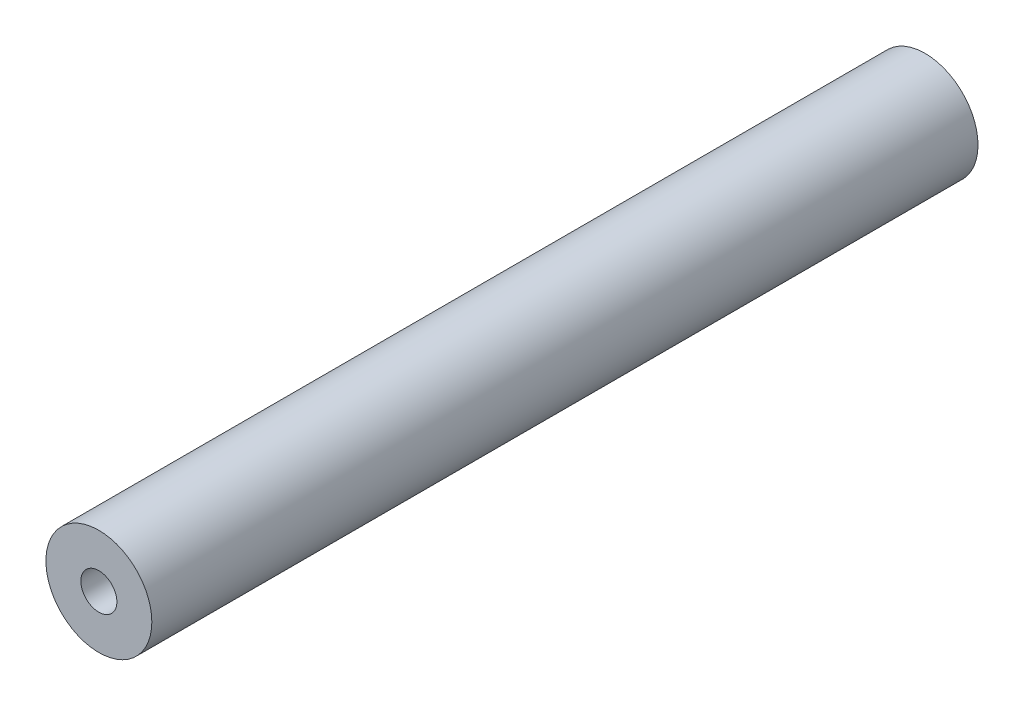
ISO-10303-21;
HEADER;
FILE_DESCRIPTION(('STEP AP214'),'2;1');
FILE_NAME('part.step','',(''),(''),'','','');
FILE_SCHEMA(('AUTOMOTIVE_DESIGN { 1 0 10303 214 1 1 1 1 }'));
ENDSEC;
DATA;
#1=APPLICATION_CONTEXT('core data for automotive mechanical design processes');
#2=APPLICATION_PROTOCOL_DEFINITION('international standard','automotive_design',2000,#1);
#3=PRODUCT_CONTEXT('',#1,'mechanical');
#4=PRODUCT('Part','Part','',(#3));
#5=PRODUCT_RELATED_PRODUCT_CATEGORY('part','',(#4));
#6=PRODUCT_DEFINITION_FORMATION('','',#4);
#7=PRODUCT_DEFINITION_CONTEXT('part definition',#1,'design');
#8=PRODUCT_DEFINITION('design','',#6,#7);
#9=PRODUCT_DEFINITION_SHAPE('','',#8);
#10=(LENGTH_UNIT() NAMED_UNIT(*) SI_UNIT(.MILLI.,.METRE.));
#11=(NAMED_UNIT(*) PLANE_ANGLE_UNIT() SI_UNIT($,.RADIAN.));
#12=(NAMED_UNIT(*) SI_UNIT($,.STERADIAN.) SOLID_ANGLE_UNIT());
#13=UNCERTAINTY_MEASURE_WITH_UNIT(LENGTH_MEASURE(1.E-05),#10,'distance_accuracy_value','');
#14=(GEOMETRIC_REPRESENTATION_CONTEXT(3) GLOBAL_UNCERTAINTY_ASSIGNED_CONTEXT((#13)) GLOBAL_UNIT_ASSIGNED_CONTEXT((#10,
#11,#12)) REPRESENTATION_CONTEXT('',''));
#15=CARTESIAN_POINT('',(0.,0.,0.));
#16=DIRECTION('',(0.,0.,1.));
#17=DIRECTION('',(1.,0.,0.));
#18=AXIS2_PLACEMENT_3D('',#15,#16,#17);
#19=CARTESIAN_POINT('',(0.,1.52655665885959E-13,195.));
#20=DIRECTION('',(0.,0.,-1.));
#21=DIRECTION('',(-1.,0.,0.));
#22=AXIS2_PLACEMENT_3D('',#19,#20,#21);
#23=CYLINDRICAL_SURFACE('',#22,12.5);
#24=CARTESIAN_POINT('',(0.,1.52655665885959E-13,195.));
#25=DIRECTION('',(0.,0.,1.));
#26=DIRECTION('',(1.,0.,0.));
#27=AXIS2_PLACEMENT_3D('',#24,#25,#26);
#28=CIRCLE('',#27,12.5);
#29=CARTESIAN_POINT('',(12.5,1.42160588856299E-13,195.));
#30=VERTEX_POINT('',#29);
#31=EDGE_CURVE('E12',#30,#30,#28,.T.);
#32=ORIENTED_EDGE('',*,*,#31,.F.);
#33=EDGE_LOOP('',(#32));
#34=FACE_BOUND('',#33,.T.);
#35=CARTESIAN_POINT('',(0.,0.,0.));
#36=DIRECTION('',(0.,0.,1.));
#37=DIRECTION('',(1.,0.,0.));
#38=AXIS2_PLACEMENT_3D('',#35,#36,#37);
#39=CIRCLE('',#38,12.5);
#40=CARTESIAN_POINT('',(12.5,0.,0.));
#41=VERTEX_POINT('',#40);
#42=EDGE_CURVE('E43',#41,#41,#39,.T.);
#43=ORIENTED_EDGE('',*,*,#42,.T.);
#44=EDGE_LOOP('',(#43));
#45=FACE_BOUND('',#44,.T.);
#46=ADVANCED_FACE('F37',(#34,#45),#23,.T.);
#47=CARTESIAN_POINT('',(0.,1.52655665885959E-13,195.));
#48=DIRECTION('',(0.,0.,1.));
#49=DIRECTION('',(1.,0.,0.));
#50=AXIS2_PLACEMENT_3D('',#47,#48,#49);
#51=PLANE('',#50);
#52=CARTESIAN_POINT('',(0.,1.52655665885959E-13,195.));
#53=DIRECTION('',(0.,0.,1.));
#54=DIRECTION('',(1.,0.,0.));
#55=AXIS2_PLACEMENT_3D('',#52,#53,#54);
#56=CIRCLE('',#55,4.25);
#57=CARTESIAN_POINT('',(4.25,1.49087339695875E-13,195.));
#58=VERTEX_POINT('',#57);
#59=EDGE_CURVE('E51',#58,#58,#56,.T.);
#60=ORIENTED_EDGE('',*,*,#59,.F.);
#61=EDGE_LOOP('',(#60));
#62=FACE_BOUND('',#61,.T.);
#63=ORIENTED_EDGE('',*,*,#31,.T.);
#64=EDGE_LOOP('',(#63));
#65=FACE_BOUND('',#64,.T.);
#66=ADVANCED_FACE('F69',(#62,#65),#51,.T.);
#67=CARTESIAN_POINT('',(0.,0.,0.));
#68=DIRECTION('',(0.,0.,1.));
#69=DIRECTION('',(1.,0.,0.));
#70=AXIS2_PLACEMENT_3D('',#67,#68,#69);
#71=PLANE('',#70);
#72=CARTESIAN_POINT('',(0.,0.,0.));
#73=DIRECTION('',(0.,0.,-1.));
#74=DIRECTION('',(-1.,0.,0.));
#75=AXIS2_PLACEMENT_3D('',#72,#73,#74);
#76=CIRCLE('',#75,4.25);
#77=CARTESIAN_POINT('',(-4.25,0.,0.));
#78=VERTEX_POINT('',#77);
#79=EDGE_CURVE('E59',#78,#78,#76,.T.);
#80=ORIENTED_EDGE('',*,*,#79,.F.);
#81=EDGE_LOOP('',(#80));
#82=FACE_BOUND('',#81,.T.);
#83=ORIENTED_EDGE('',*,*,#42,.F.);
#84=EDGE_LOOP('',(#83));
#85=FACE_BOUND('',#84,.T.);
#86=ADVANCED_FACE('F65',(#82,#85),#71,.F.);
#87=CARTESIAN_POINT('',(-6.10622663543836E-13,1.11022302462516E-13,175.));
#88=DIRECTION('',(0.,0.,1.));
#89=DIRECTION('',(1.,0.,0.));
#90=AXIS2_PLACEMENT_3D('',#87,#88,#89);
#91=CYLINDRICAL_SURFACE('',#90,4.25);
#92=CARTESIAN_POINT('',(-6.10622663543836E-13,1.11022302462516E-13,175.));
#93=DIRECTION('',(0.,0.,1.));
#94=DIRECTION('',(1.,0.,0.));
#95=AXIS2_PLACEMENT_3D('',#92,#93,#94);
#96=CIRCLE('',#95,4.25);
#97=CARTESIAN_POINT('',(4.24999999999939,1.07453976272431E-13,175.));
#98=VERTEX_POINT('',#97);
#99=EDGE_CURVE('E47',#98,#98,#96,.T.);
#100=ORIENTED_EDGE('',*,*,#99,.F.);
#101=EDGE_LOOP('',(#100));
#102=FACE_BOUND('',#101,.T.);
#103=ORIENTED_EDGE('',*,*,#59,.T.);
#104=EDGE_LOOP('',(#103));
#105=FACE_BOUND('',#104,.T.);
#106=ADVANCED_FACE('F68',(#102,#105),#91,.F.);
#107=CARTESIAN_POINT('',(-6.10622663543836E-13,1.11022302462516E-13,175.));
#108=DIRECTION('',(0.,0.,1.));
#109=DIRECTION('',(1.,0.,0.));
#110=AXIS2_PLACEMENT_3D('',#107,#108,#109);
#111=PLANE('',#110);
#112=ORIENTED_EDGE('',*,*,#99,.T.);
#113=EDGE_LOOP('',(#112));
#114=FACE_BOUND('',#113,.T.);
#115=ADVANCED_FACE('F75',(#114),#111,.T.);
#116=CARTESIAN_POINT('',(-6.10622663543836E-13,0.,20.));
#117=DIRECTION('',(0.,0.,-1.));
#118=DIRECTION('',(-1.,0.,0.));
#119=AXIS2_PLACEMENT_3D('',#116,#117,#118);
#120=CYLINDRICAL_SURFACE('',#119,4.25);
#121=CARTESIAN_POINT('',(-6.10622663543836E-13,0.,20.));
#122=DIRECTION('',(0.,0.,-1.));
#123=DIRECTION('',(-1.,0.,0.));
#124=AXIS2_PLACEMENT_3D('',#121,#122,#123);
#125=CIRCLE('',#124,4.25);
#126=CARTESIAN_POINT('',(-4.25000000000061,0.,20.));
#127=VERTEX_POINT('',#126);
#128=EDGE_CURVE('E56',#127,#127,#125,.T.);
#129=ORIENTED_EDGE('',*,*,#128,.F.);
#130=EDGE_LOOP('',(#129));
#131=FACE_BOUND('',#130,.T.);
#132=ORIENTED_EDGE('',*,*,#79,.T.);
#133=EDGE_LOOP('',(#132));
#134=FACE_BOUND('',#133,.T.);
#135=ADVANCED_FACE('F63',(#131,#134),#120,.F.);
#136=CARTESIAN_POINT('',(-6.10622663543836E-13,0.,20.));
#137=DIRECTION('',(0.,0.,-1.));
#138=DIRECTION('',(-1.,0.,0.));
#139=AXIS2_PLACEMENT_3D('',#136,#137,#138);
#140=PLANE('',#139);
#141=ORIENTED_EDGE('',*,*,#128,.T.);
#142=EDGE_LOOP('',(#141));
#143=FACE_BOUND('',#142,.T.);
#144=ADVANCED_FACE('F91',(#143),#140,.T.);
#145=CLOSED_SHELL('',(#46,#66,#86,#106,#115,#135,#144));
#146=MANIFOLD_SOLID_BREP('B2',#145);
#147=ADVANCED_BREP_SHAPE_REPRESENTATION('',(#18,#146),#14);
#148=SHAPE_DEFINITION_REPRESENTATION(#9,#147);
ENDSEC;
END-ISO-10303-21;
